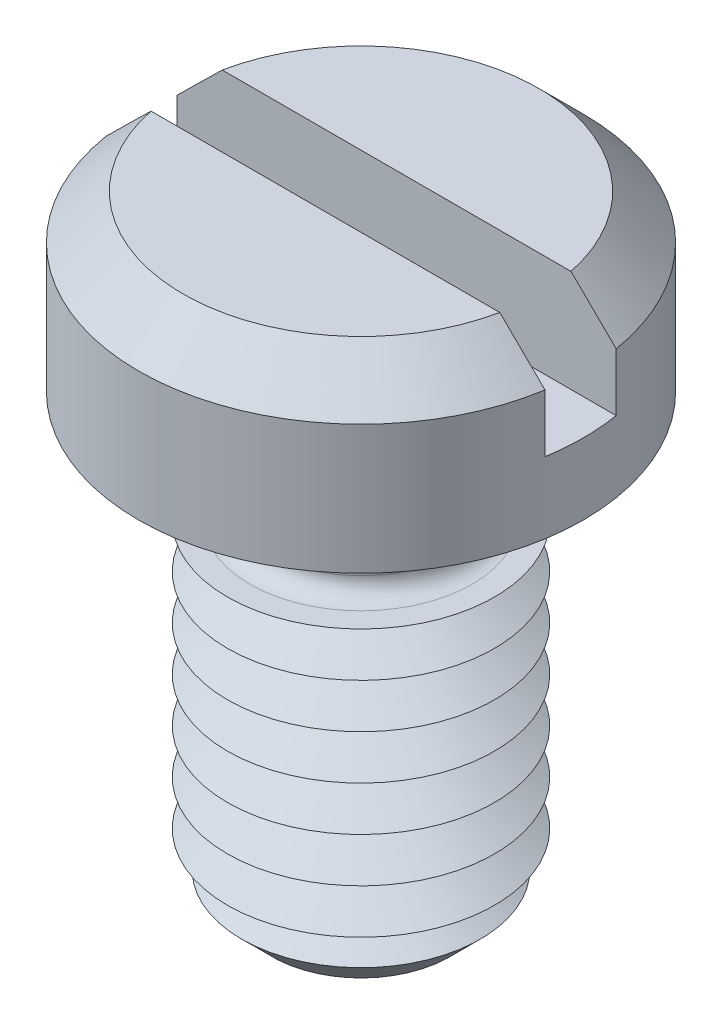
from build123d import *

# Parameters (mm, degrees)
SKETCH1_R           = 5
BOSS_EXTRUDE1_DEPTH = 3.9
SKETCH2_R           = 2.1
BOSS_EXTRUDE2_DEPTH = 10
SKETCH3_R           = 3
BOSS_EXTRUDE3_DEPTH = 7.5
CHAMFER1_SIZE       = 1
LPATTERN1_COUNT     = 7
LPATTERN1_PITCH     = 1
FILLET1_R           = 0.4
CHAMFER2_SIZE       = 1
SKETCH6_W           = 10
SKETCH6_H           = 1.6
CUT_EXTRUDE1_DEPTH  = 2.3


with BuildPart() as part:
    # Sketch1 → Boss-Extrude1 (new body)
    with BuildSketch(Plane(origin=(0, 0, 0), x_dir=(1, 0, 0), z_dir=(0, 1, 0))):
        with Locations(Location((0, 0, 0), (0, 0, 270))):
            Circle(SKETCH1_R)
    extrude(amount=BOSS_EXTRUDE1_DEPTH)

    # Sketch2 → Boss-Extrude2 (add)
    with BuildSketch(Plane.XZ):
        with Locations(Location((0, 0, 0), (0, 0, 270))):
            Circle(SKETCH2_R)
    extrude(amount=BOSS_EXTRUDE2_DEPTH)

    # Sketch3 → Boss-Extrude3 (add)
    with BuildSketch(Plane.XZ.offset(10)):
        with Locations(Location((0, 0, 0), (0, 0, 270))):
            Circle(SKETCH3_R)
    extrude(amount=-BOSS_EXTRUDE3_DEPTH)

    # Chamfer1
    chamfer1_edges = [part.edges().sort_by_distance(p)[0] for p in [
        (0, -10, 3),
    ]]
    chamfer(chamfer1_edges, length=CHAMFER1_SIZE)

    # Sketch5 → Cut-Revolve1 (revolve, cut)
    with BuildSketch(Plane(origin=(0, 0, 0), x_dir=(0, 0, -1), z_dir=(1, 0, 0))):
        Polygon((-3, -2.5), (-2.133974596, -3), (-3, -3.5), align=None)
    cut_revolve1 = revolve(axis=Axis((0, -6.58711856, 0), (0, -1, 0)), mode=Mode.SUBTRACT)

    # LPattern1: Cut-Revolve1 ×7
    with Locations(*[(0, -i * LPATTERN1_PITCH, 0) for i in range(1, LPATTERN1_COUNT)]):
        add(cut_revolve1, mode=Mode.SUBTRACT)

    # Fillet1
    fillet1_edges = [part.edges().sort_by_distance(p)[0] for p in [
        (0, 0, 2.1),
        (0, -2.5, 2.1),
    ]]
    fillet(fillet1_edges, radius=FILLET1_R)

    # Chamfer2
    chamfer2_edges = [part.edges().sort_by_distance(p)[0] for p in [
        (0, 3.9, -5),
    ]]
    chamfer(chamfer2_edges, length=CHAMFER2_SIZE)

    # Sketch6 → Cut-Extrude1 (cut)
    with BuildSketch(Plane(origin=(0, 3.9, 0), x_dir=(1, 0, 0), z_dir=(0, 1, 0))):
        Rectangle(SKETCH6_W, SKETCH6_H)
    extrude(amount=-CUT_EXTRUDE1_DEPTH, mode=Mode.SUBTRACT)


solid = part.part
